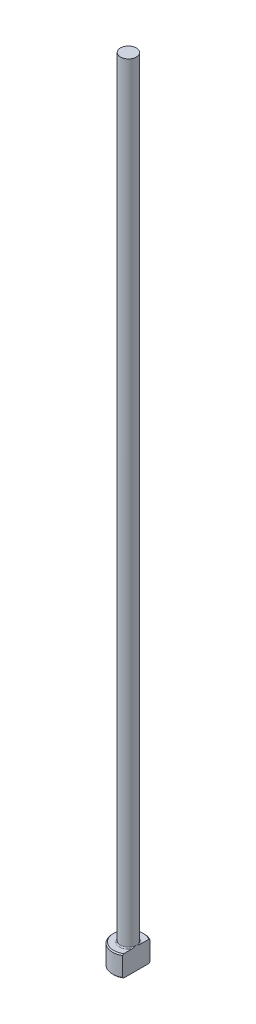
ISO-10303-21;
HEADER;
FILE_DESCRIPTION(('STEP AP214'),'2;1');
FILE_NAME('part.step','',(''),(''),'','','');
FILE_SCHEMA(('AUTOMOTIVE_DESIGN { 1 0 10303 214 1 1 1 1 }'));
ENDSEC;
DATA;
#1=APPLICATION_CONTEXT('core data for automotive mechanical design processes');
#2=APPLICATION_PROTOCOL_DEFINITION('international standard','automotive_design',2000,#1);
#3=PRODUCT_CONTEXT('',#1,'mechanical');
#4=PRODUCT('Part','Part','',(#3));
#5=PRODUCT_RELATED_PRODUCT_CATEGORY('part','',(#4));
#6=PRODUCT_DEFINITION_FORMATION('','',#4);
#7=PRODUCT_DEFINITION_CONTEXT('part definition',#1,'design');
#8=PRODUCT_DEFINITION('design','',#6,#7);
#9=PRODUCT_DEFINITION_SHAPE('','',#8);
#10=(LENGTH_UNIT() NAMED_UNIT(*) SI_UNIT(.MILLI.,.METRE.));
#11=(NAMED_UNIT(*) PLANE_ANGLE_UNIT() SI_UNIT($,.RADIAN.));
#12=(NAMED_UNIT(*) SI_UNIT($,.STERADIAN.) SOLID_ANGLE_UNIT());
#13=UNCERTAINTY_MEASURE_WITH_UNIT(LENGTH_MEASURE(1.E-05),#10,'distance_accuracy_value','');
#14=(GEOMETRIC_REPRESENTATION_CONTEXT(3) GLOBAL_UNCERTAINTY_ASSIGNED_CONTEXT((#13)) GLOBAL_UNIT_ASSIGNED_CONTEXT((#10,
#11,#12)) REPRESENTATION_CONTEXT('',''));
#15=CARTESIAN_POINT('',(0.,0.,0.));
#16=DIRECTION('',(0.,0.,1.));
#17=DIRECTION('',(1.,0.,0.));
#18=AXIS2_PLACEMENT_3D('',#15,#16,#17);
#19=CARTESIAN_POINT('',(0.,0.,0.));
#20=DIRECTION('',(0.,-1.,0.));
#21=DIRECTION('',(0.,0.,-1.));
#22=AXIS2_PLACEMENT_3D('',#19,#20,#21);
#23=PLANE('',#22);
#24=CARTESIAN_POINT('',(0.,0.,0.));
#25=DIRECTION('',(0.,-1.,0.));
#26=DIRECTION('',(0.,0.,-1.));
#27=AXIS2_PLACEMENT_3D('',#24,#25,#26);
#28=CIRCLE('',#27,2.8);
#29=CARTESIAN_POINT('',(1.49999999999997,0.,2.36431808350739));
#30=VERTEX_POINT('',#29);
#31=CARTESIAN_POINT('',(1.49999999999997,0.,-2.36431808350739));
#32=VERTEX_POINT('',#31);
#33=EDGE_CURVE('E98',#30,#32,#28,.T.);
#34=ORIENTED_EDGE('',*,*,#33,.T.);
#35=DIRECTION('',(0.,0.,1.));
#36=VECTOR('',#35,1.);
#37=CARTESIAN_POINT('',(1.49999999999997,0.,2.5980762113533));
#38=LINE('',#37,#36);
#39=EDGE_CURVE('E83',#32,#30,#38,.T.);
#40=ORIENTED_EDGE('',*,*,#39,.T.);
#41=EDGE_LOOP('',(#34,#40));
#42=FACE_BOUND('',#41,.T.);
#43=ADVANCED_FACE('F32',(#42),#23,.T.);
#44=CARTESIAN_POINT('',(0.,259.958771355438,0.));
#45=DIRECTION('',(0.,1.,0.));
#46=DIRECTION('',(0.,0.,1.));
#47=AXIS2_PLACEMENT_3D('',#44,#45,#46);
#48=CYLINDRICAL_SURFACE('',#47,2.99999999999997);
#49=CARTESIAN_POINT('',(0.,3.79999999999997,0.));
#50=DIRECTION('',(0.,1.,0.));
#51=DIRECTION('',(0.,0.,1.));
#52=AXIS2_PLACEMENT_3D('',#49,#50,#51);
#53=CIRCLE('',#52,2.99999999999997);
#54=CARTESIAN_POINT('',(1.49999999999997,3.79999999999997,2.5980762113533));
#55=VERTEX_POINT('',#54);
#56=CARTESIAN_POINT('',(1.49999999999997,3.79999999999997,-2.5980762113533));
#57=VERTEX_POINT('',#56);
#58=EDGE_CURVE('E104',#55,#57,#53,.F.);
#59=ORIENTED_EDGE('',*,*,#58,.T.);
#60=DIRECTION('',(0.,-1.,0.));
#61=VECTOR('',#60,1.);
#62=CARTESIAN_POINT('',(1.49999999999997,150.,-2.5980762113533));
#63=LINE('',#62,#61);
#64=CARTESIAN_POINT('',(1.49999999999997,0.199999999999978,-2.5980762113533));
#65=VERTEX_POINT('',#64);
#66=EDGE_CURVE('E183',#57,#65,#63,.T.);
#67=ORIENTED_EDGE('',*,*,#66,.T.);
#68=CARTESIAN_POINT('',(0.,0.199999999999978,0.));
#69=DIRECTION('',(0.,-1.,0.));
#70=DIRECTION('',(0.,0.,-1.));
#71=AXIS2_PLACEMENT_3D('',#68,#69,#70);
#72=CIRCLE('',#71,2.99999999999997);
#73=CARTESIAN_POINT('',(1.49999999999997,0.199999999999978,2.5980762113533));
#74=VERTEX_POINT('',#73);
#75=EDGE_CURVE('E100',#65,#74,#72,.F.);
#76=ORIENTED_EDGE('',*,*,#75,.T.);
#77=DIRECTION('',(0.,-1.,0.));
#78=VECTOR('',#77,1.);
#79=CARTESIAN_POINT('',(1.49999999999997,150.,2.5980762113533));
#80=LINE('',#79,#78);
#81=EDGE_CURVE('E93',#55,#74,#80,.T.);
#82=ORIENTED_EDGE('',*,*,#81,.F.);
#83=EDGE_LOOP('',(#59,#67,#76,#82));
#84=FACE_BOUND('',#83,.T.);
#85=ADVANCED_FACE('F158',(#84),#48,.T.);
#86=CARTESIAN_POINT('',(-2.99999999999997,4.,0.));
#87=DIRECTION('',(0.,1.,0.));
#88=DIRECTION('',(0.,0.,1.));
#89=AXIS2_PLACEMENT_3D('',#86,#87,#88);
#90=PLANE('',#89);
#91=CARTESIAN_POINT('',(0.,4.,0.));
#92=DIRECTION('',(0.,1.,0.));
#93=DIRECTION('',(0.,0.,1.));
#94=AXIS2_PLACEMENT_3D('',#91,#92,#93);
#95=CIRCLE('',#94,2.79999999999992);
#96=CARTESIAN_POINT('',(1.49999999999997,4.,-2.3643180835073));
#97=VERTEX_POINT('',#96);
#98=CARTESIAN_POINT('',(1.49999999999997,4.,2.3643180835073));
#99=VERTEX_POINT('',#98);
#100=EDGE_CURVE('E178',#97,#99,#95,.T.);
#101=ORIENTED_EDGE('',*,*,#100,.T.);
#102=DIRECTION('',(0.,0.,-1.));
#103=VECTOR('',#102,1.);
#104=CARTESIAN_POINT('',(1.49999999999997,4.,0.));
#105=LINE('',#104,#103);
#106=CARTESIAN_POINT('',(1.49999999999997,3.99999999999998,0.799999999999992));
#107=VERTEX_POINT('',#106);
#108=EDGE_CURVE('E57',#99,#107,#105,.T.);
#109=ORIENTED_EDGE('',*,*,#108,.T.);
#110=CARTESIAN_POINT('',(0.,4.,0.));
#111=DIRECTION('',(0.,1.,0.));
#112=DIRECTION('',(0.,0.,1.));
#113=AXIS2_PLACEMENT_3D('',#110,#111,#112);
#114=CIRCLE('',#113,1.69999999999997);
#115=CARTESIAN_POINT('',(1.49999999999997,3.99999999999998,-0.799999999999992));
#116=VERTEX_POINT('',#115);
#117=EDGE_CURVE('E107',#107,#116,#114,.F.);
#118=ORIENTED_EDGE('',*,*,#117,.T.);
#119=EDGE_CURVE('E136',#116,#97,#105,.T.);
#120=ORIENTED_EDGE('',*,*,#119,.T.);
#121=EDGE_LOOP('',(#101,#109,#118,#120));
#122=FACE_BOUND('',#121,.T.);
#123=ADVANCED_FACE('F147',(#122),#90,.T.);
#124=CARTESIAN_POINT('',(0.,4.,0.));
#125=DIRECTION('',(0.,-1.,0.));
#126=DIRECTION('',(0.,0.,-1.));
#127=AXIS2_PLACEMENT_3D('',#124,#125,#126);
#128=CONICAL_SURFACE('',#127,2.79999999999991,0.7853981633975);
#129=ORIENTED_EDGE('',*,*,#58,.F.);
#130=CARTESIAN_POINT('',(1.49999999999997,0.888258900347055,5.71827621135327));
#131=CARTESIAN_POINT('',(1.49999999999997,1.01361833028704,5.58866816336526));
#132=CARTESIAN_POINT('',(1.49999999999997,1.13884324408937,5.45892957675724));
#133=CARTESIAN_POINT('',(1.49999999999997,1.38894444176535,5.19911365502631));
#134=CARTESIAN_POINT('',(1.49999999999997,1.51382072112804,5.06903631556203));
#135=CARTESIAN_POINT('',(1.49999999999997,1.76320568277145,4.8084018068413));
#136=CARTESIAN_POINT('',(1.49999999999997,1.88771414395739,4.67784442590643));
#137=CARTESIAN_POINT('',(1.49999999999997,2.13618059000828,4.41620813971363));
#138=CARTESIAN_POINT('',(1.49999999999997,2.26013857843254,4.28512923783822));
#139=CARTESIAN_POINT('',(1.49999999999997,2.50488975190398,4.02490837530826));
#140=CARTESIAN_POINT('',(1.49999999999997,2.62569693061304,3.89577958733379));
#141=CARTESIAN_POINT('',(1.49999999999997,2.86640694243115,3.63668213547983));
#142=CARTESIAN_POINT('',(1.49999999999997,2.98630978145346,3.5067134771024));
#143=CARTESIAN_POINT('',(1.49999999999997,3.22486033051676,3.24567921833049));
#144=CARTESIAN_POINT('',(1.49999999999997,3.34350830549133,3.11461386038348));
#145=CARTESIAN_POINT('',(1.49999999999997,3.57907716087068,2.85094268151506));
#146=CARTESIAN_POINT('',(1.49999999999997,3.69599811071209,2.71833692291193));
#147=CARTESIAN_POINT('',(1.49999999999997,3.88262371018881,2.50255231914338));
#148=CARTESIAN_POINT('',(1.49999999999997,3.95312454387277,2.42006293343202));
#149=CARTESIAN_POINT('',(1.49999999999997,4.09287098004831,2.25401084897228));
#150=CARTESIAN_POINT('',(1.49999999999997,4.16211645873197,2.170448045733));
#151=CARTESIAN_POINT('',(1.49999999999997,4.29964684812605,2.00105967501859));
#152=CARTESIAN_POINT('',(1.49999999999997,4.36791386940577,1.91521952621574));
#153=CARTESIAN_POINT('',(1.49999999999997,4.50205840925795,1.74171392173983));
#154=CARTESIAN_POINT('',(1.49999999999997,4.56793649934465,1.65404891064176));
#155=CARTESIAN_POINT('',(1.49999999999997,4.69728151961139,1.47490236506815));
#156=CARTESIAN_POINT('',(1.49999999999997,4.76069661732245,1.38338308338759));
#157=CARTESIAN_POINT('',(1.49999999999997,4.88239539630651,1.1967566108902));
#158=CARTESIAN_POINT('',(1.49999999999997,4.9406720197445,1.10164473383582));
#159=CARTESIAN_POINT('',(1.49999999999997,5.04841325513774,0.908008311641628));
#160=CARTESIAN_POINT('',(1.49999999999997,5.09797809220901,0.809540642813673));
#161=CARTESIAN_POINT('',(1.49999999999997,5.18432188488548,0.607192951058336));
#162=CARTESIAN_POINT('',(1.49999999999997,5.22114374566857,0.503332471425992));
#163=CARTESIAN_POINT('',(1.49999999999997,5.26099935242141,0.347577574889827));
#164=CARTESIAN_POINT('',(1.49999999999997,5.27157029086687,0.297609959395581));
#165=CARTESIAN_POINT('',(1.49999999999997,5.28794860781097,0.196885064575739));
#166=CARTESIAN_POINT('',(1.49999999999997,5.29375640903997,0.146127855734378));
#167=CARTESIAN_POINT('',(1.49999999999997,5.3001970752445,0.0444388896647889));
#168=CARTESIAN_POINT('',(1.49999999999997,5.3008459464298,-0.00649183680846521));
#169=CARTESIAN_POINT('',(1.49999999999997,5.29696416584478,-0.108155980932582));
#170=CARTESIAN_POINT('',(1.49999999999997,5.29243308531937,-0.158889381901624));
#171=CARTESIAN_POINT('',(1.49999999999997,5.2785691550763,-0.259234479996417));
#172=CARTESIAN_POINT('',(1.49999999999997,5.2692782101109,-0.308852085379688));
#173=CARTESIAN_POINT('',(1.49999999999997,5.24647108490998,-0.40711049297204));
#174=CARTESIAN_POINT('',(1.49999999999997,5.23295324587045,-0.455750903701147));
#175=CARTESIAN_POINT('',(1.49999999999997,5.20226175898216,-0.552149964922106));
#176=CARTESIAN_POINT('',(1.49999999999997,5.18506801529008,-0.5999021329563));
#177=CARTESIAN_POINT('',(1.49999999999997,5.14771387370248,-0.694205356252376));
#178=CARTESIAN_POINT('',(1.49999999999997,5.12755408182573,-0.740756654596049));
#179=CARTESIAN_POINT('',(1.49999999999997,5.06327696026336,-0.879166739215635));
#180=CARTESIAN_POINT('',(1.49999999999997,5.01551721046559,-0.969329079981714));
#181=CARTESIAN_POINT('',(1.49999999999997,4.91367909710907,-1.1460431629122));
#182=CARTESIAN_POINT('',(1.49999999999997,4.85959300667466,-1.23259031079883));
#183=CARTESIAN_POINT('',(1.49999999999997,4.74697968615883,-1.40321348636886));
#184=CARTESIAN_POINT('',(1.49999999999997,4.68843573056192,-1.48727838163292));
#185=CARTESIAN_POINT('',(1.49999999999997,4.56843845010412,-1.6532218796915));
#186=CARTESIAN_POINT('',(1.49999999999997,4.50698656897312,-1.73510153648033));
#187=CARTESIAN_POINT('',(1.49999999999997,4.38115673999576,-1.89829823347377));
#188=CARTESIAN_POINT('',(1.49999999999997,4.31675092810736,-1.9795936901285));
#189=CARTESIAN_POINT('',(1.49999999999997,4.18634068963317,-2.14090082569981));
#190=CARTESIAN_POINT('',(1.49999999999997,4.12033609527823,-2.22091236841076));
#191=CARTESIAN_POINT('',(1.49999999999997,3.92086431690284,-2.4590650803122));
#192=CARTESIAN_POINT('',(1.49999999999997,3.78562663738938,-2.61572090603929));
#193=CARTESIAN_POINT('',(1.49999999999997,3.53554498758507,-2.90006295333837));
#194=CARTESIAN_POINT('',(1.49999999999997,3.42114543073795,-3.02814382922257));
#195=CARTESIAN_POINT('',(1.49999999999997,3.19093557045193,-3.28303767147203));
#196=CARTESIAN_POINT('',(1.49999999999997,3.07512522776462,-3.40985060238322));
#197=CARTESIAN_POINT('',(1.49999999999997,2.72597067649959,-3.78913849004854));
#198=CARTESIAN_POINT('',(1.49999999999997,2.49111760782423,-4.04022177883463));
#199=CARTESIAN_POINT('',(1.49999999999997,2.02882478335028,-4.52992803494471));
#200=CARTESIAN_POINT('',(1.49999999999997,1.80147747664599,-4.76863870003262));
#201=CARTESIAN_POINT('',(1.49999999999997,1.45954865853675,-5.12558036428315));
#202=CARTESIAN_POINT('',(1.49999999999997,1.34548484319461,-5.24430773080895));
#203=CARTESIAN_POINT('',(1.49999999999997,1.11707176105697,-5.48148573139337));
#204=CARTESIAN_POINT('',(1.49999999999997,1.00272249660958,-5.59993636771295));
#205=CARTESIAN_POINT('',(1.49999999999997,0.888258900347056,-5.71827621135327));
#206=B_SPLINE_CURVE_WITH_KNOTS('',3,(#130,#131,#132,#133,#134,#135,#136,#137,#138,#139,#140,
#141,#142,#143,#144,#145,#146,#147,#148,#149,#150,#151,#152,#153,#154,#155,#156,#157,#158,#159,
#160,#161,#162,#163,#164,#165,#166,#167,#168,#169,#170,#171,#172,#173,#174,#175,#176,#177,#178,
#179,#180,#181,#182,#183,#184,#185,#186,#187,#188,#189,#190,#191,#192,#193,#194,#195,#196,#197,
#198,#199,#200,#201,#202,#203,#204,#205),.UNSPECIFIED.,.F.,.F.,(4,2,2,2,2,2,2,2,2,2,2,2,2,2,2,2,
2,2,2,2,2,2,2,2,2,2,2,2,2,2,2,2,2,2,2,2,2,4),(0.,0.540943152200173,1.08189327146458,
1.62312052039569,2.16434426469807,2.69482920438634,3.22531067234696,3.75567781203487,
4.28602356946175,4.61155053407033,4.93710943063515,5.26610945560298,5.59503024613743,
5.92894782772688,6.26331713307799,6.59354403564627,6.92264800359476,7.07567478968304,
7.22868799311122,7.38122626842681,7.53377717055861,7.68500755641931,7.83629736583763,
7.98843643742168,8.14054446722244,8.4461879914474,8.75220879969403,9.05944044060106,
9.36652111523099,9.677642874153,9.98879742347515,10.6095925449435,11.1247803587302,
11.6399825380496,12.6713544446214,13.6603005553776,14.1542238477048,14.648143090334),.UNSPECIFIED.);
#207=EDGE_CURVE('E135',#55,#99,#206,.T.);
#208=ORIENTED_EDGE('',*,*,#207,.T.);
#209=ORIENTED_EDGE('',*,*,#100,.F.);
#210=EDGE_CURVE('E127',#97,#57,#206,.T.);
#211=ORIENTED_EDGE('',*,*,#210,.T.);
#212=EDGE_LOOP('',(#129,#208,#209,#211));
#213=FACE_BOUND('',#212,.T.);
#214=ADVANCED_FACE('F143',(#213),#128,.T.);
#215=CARTESIAN_POINT('',(0.,0.199999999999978,0.));
#216=DIRECTION('',(0.,1.,0.));
#217=DIRECTION('',(0.,0.,1.));
#218=AXIS2_PLACEMENT_3D('',#215,#216,#217);
#219=CONICAL_SURFACE('',#218,2.99999999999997,0.785398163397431);
#220=ORIENTED_EDGE('',*,*,#75,.F.);
#221=CARTESIAN_POINT('',(1.49999999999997,3.1117410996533,-5.71827621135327));
#222=CARTESIAN_POINT('',(1.49999999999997,2.98638166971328,-5.58866816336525));
#223=CARTESIAN_POINT('',(1.49999999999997,2.86115675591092,-5.45892957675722));
#224=CARTESIAN_POINT('',(1.49999999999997,2.61105555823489,-5.19911365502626));
#225=CARTESIAN_POINT('',(1.49999999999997,2.48617927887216,-5.06903631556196));
#226=CARTESIAN_POINT('',(1.49999999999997,2.23679431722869,-4.8084018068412));
#227=CARTESIAN_POINT('',(1.49999999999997,2.11228585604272,-4.67784442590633));
#228=CARTESIAN_POINT('',(1.49999999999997,1.86381940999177,-4.4162081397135));
#229=CARTESIAN_POINT('',(1.49999999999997,1.73986142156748,-4.28512923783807));
#230=CARTESIAN_POINT('',(1.49999999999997,1.49511024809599,-4.02490837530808));
#231=CARTESIAN_POINT('',(1.49999999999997,1.3743030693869,-3.8957795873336));
#232=CARTESIAN_POINT('',(1.49999999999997,1.13359305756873,-3.63668213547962));
#233=CARTESIAN_POINT('',(1.49999999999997,1.0136902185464,-3.50671347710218));
#234=CARTESIAN_POINT('',(1.49999999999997,0.775139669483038,-3.24567921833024));
#235=CARTESIAN_POINT('',(1.49999999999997,0.656491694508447,-3.11461386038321));
#236=CARTESIAN_POINT('',(1.49999999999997,0.420922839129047,-2.85094268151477));
#237=CARTESIAN_POINT('',(1.49999999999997,0.304001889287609,-2.71833692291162));
#238=CARTESIAN_POINT('',(1.49999999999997,0.117376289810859,-2.50255231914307));
#239=CARTESIAN_POINT('',(1.49999999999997,0.0468754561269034,-2.42006293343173));
#240=CARTESIAN_POINT('',(1.49999999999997,-0.0928709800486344,-2.254010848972));
#241=CARTESIAN_POINT('',(1.49999999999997,-0.162116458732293,-2.17044804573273));
#242=CARTESIAN_POINT('',(1.49999999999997,-0.299646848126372,-2.00105967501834));
#243=CARTESIAN_POINT('',(1.49999999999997,-0.367913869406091,-1.9152195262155));
#244=CARTESIAN_POINT('',(1.49999999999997,-0.502058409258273,-1.7417139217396));
#245=CARTESIAN_POINT('',(1.49999999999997,-0.567936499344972,-1.65404891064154));
#246=CARTESIAN_POINT('',(1.49999999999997,-0.697281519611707,-1.47490236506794));
#247=CARTESIAN_POINT('',(1.49999999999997,-0.76069661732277,-1.38338308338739));
#248=CARTESIAN_POINT('',(1.49999999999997,-0.882395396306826,-1.19675661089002));
#249=CARTESIAN_POINT('',(1.49999999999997,-0.940672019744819,-1.10164473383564));
#250=CARTESIAN_POINT('',(1.49999999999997,-1.04841325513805,-0.908008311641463));
#251=CARTESIAN_POINT('',(1.49999999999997,-1.09797809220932,-0.809540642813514));
#252=CARTESIAN_POINT('',(1.49999999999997,-1.18432188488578,-0.607192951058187));
#253=CARTESIAN_POINT('',(1.49999999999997,-1.22114374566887,-0.503332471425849));
#254=CARTESIAN_POINT('',(1.49999999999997,-1.26099935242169,-0.347577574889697));
#255=CARTESIAN_POINT('',(1.49999999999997,-1.27157029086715,-0.297609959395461));
#256=CARTESIAN_POINT('',(1.49999999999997,-1.28794860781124,-0.196885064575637));
#257=CARTESIAN_POINT('',(1.49999999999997,-1.29375640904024,-0.146127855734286));
#258=CARTESIAN_POINT('',(1.49999999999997,-1.30019707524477,-0.0444388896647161));
#259=CARTESIAN_POINT('',(1.49999999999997,-1.30084594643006,0.00649183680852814));
#260=CARTESIAN_POINT('',(1.49999999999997,-1.29696416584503,0.108155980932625));
#261=CARTESIAN_POINT('',(1.49999999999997,-1.29243308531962,0.158889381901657));
#262=CARTESIAN_POINT('',(1.49999999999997,-1.27856915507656,0.259234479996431));
#263=CARTESIAN_POINT('',(1.49999999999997,-1.26927821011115,0.308852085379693));
#264=CARTESIAN_POINT('',(1.49999999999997,-1.24647108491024,0.407110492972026));
#265=CARTESIAN_POINT('',(1.49999999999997,-1.2329532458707,0.455750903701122));
#266=CARTESIAN_POINT('',(1.49999999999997,-1.20226175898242,0.552149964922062));
#267=CARTESIAN_POINT('',(1.49999999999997,-1.18506801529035,0.599902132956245));
#268=CARTESIAN_POINT('',(1.49999999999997,-1.14771387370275,0.694205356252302));
#269=CARTESIAN_POINT('',(1.49999999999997,-1.12755408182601,0.740756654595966));
#270=CARTESIAN_POINT('',(1.49999999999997,-1.06327696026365,0.879166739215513));
#271=CARTESIAN_POINT('',(1.49999999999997,-1.0155172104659,0.969329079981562));
#272=CARTESIAN_POINT('',(1.49999999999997,-0.913679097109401,1.14604316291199));
#273=CARTESIAN_POINT('',(1.49999999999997,-0.859593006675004,1.2325903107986));
#274=CARTESIAN_POINT('',(1.49999999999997,-0.746979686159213,1.40321348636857));
#275=CARTESIAN_POINT('',(1.49999999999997,-0.688435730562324,1.4872783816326));
#276=CARTESIAN_POINT('',(1.49999999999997,-0.56843845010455,1.65322187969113));
#277=CARTESIAN_POINT('',(1.49999999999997,-0.506986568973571,1.73510153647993));
#278=CARTESIAN_POINT('',(1.49999999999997,-0.381156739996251,1.89829823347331));
#279=CARTESIAN_POINT('',(1.49999999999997,-0.316750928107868,1.97959369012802));
#280=CARTESIAN_POINT('',(1.49999999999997,-0.186340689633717,2.14090082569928));
#281=CARTESIAN_POINT('',(1.49999999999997,-0.120336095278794,2.2209123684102));
#282=CARTESIAN_POINT('',(1.49999999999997,0.0791356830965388,2.45906508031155));
#283=CARTESIAN_POINT('',(1.49999999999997,0.214373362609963,2.6157209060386));
#284=CARTESIAN_POINT('',(1.49999999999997,0.464455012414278,2.90006295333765));
#285=CARTESIAN_POINT('',(1.49999999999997,0.578854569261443,3.02814382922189));
#286=CARTESIAN_POINT('',(1.49999999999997,0.809064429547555,3.28303767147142));
#287=CARTESIAN_POINT('',(1.49999999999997,0.92487477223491,3.40985060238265));
#288=CARTESIAN_POINT('',(1.49999999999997,1.27402932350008,3.78913849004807));
#289=CARTESIAN_POINT('',(1.49999999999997,1.50888239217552,4.04022177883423));
#290=CARTESIAN_POINT('',(1.49999999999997,1.97117521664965,4.52992803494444));
#291=CARTESIAN_POINT('',(1.49999999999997,2.19852252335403,4.76863870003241));
#292=CARTESIAN_POINT('',(1.49999999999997,2.54045134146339,5.12558036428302));
#293=CARTESIAN_POINT('',(1.49999999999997,2.65451515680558,5.24430773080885));
#294=CARTESIAN_POINT('',(1.49999999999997,2.8829282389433,5.48148573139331));
#295=CARTESIAN_POINT('',(1.49999999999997,2.99727750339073,5.59993636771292));
#296=CARTESIAN_POINT('',(1.49999999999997,3.1117410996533,5.71827621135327));
#297=B_SPLINE_CURVE_WITH_KNOTS('',3,(#221,#222,#223,#224,#225,#226,#227,#228,#229,#230,#231,
#232,#233,#234,#235,#236,#237,#238,#239,#240,#241,#242,#243,#244,#245,#246,#247,#248,#249,#250,
#251,#252,#253,#254,#255,#256,#257,#258,#259,#260,#261,#262,#263,#264,#265,#266,#267,#268,#269,
#270,#271,#272,#273,#274,#275,#276,#277,#278,#279,#280,#281,#282,#283,#284,#285,#286,#287,#288,
#289,#290,#291,#292,#293,#294,#295,#296),.UNSPECIFIED.,.F.,.F.,(4,2,2,2,2,2,2,2,2,2,2,2,2,2,2,2,
2,2,2,2,2,2,2,2,2,2,2,2,2,2,2,2,2,2,2,2,2,4),(0.,0.540943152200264,1.08189327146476,
1.62312052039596,2.16434426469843,2.69482920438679,3.22531067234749,3.75567781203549,
4.28602356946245,4.611550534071,4.9371094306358,5.26610945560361,5.59503024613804,
5.92894782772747,6.26331713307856,6.59354403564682,6.92264800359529,7.07567478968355,
7.2286879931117,7.38122626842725,7.53377717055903,7.6850075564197,7.83629736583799,
7.98843643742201,8.14054446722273,8.44618799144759,8.75220879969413,9.05944044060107,
9.3665211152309,9.67764287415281,9.98879742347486,10.609592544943,11.1247803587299,
11.6399825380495,12.6713544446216,13.6603005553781,14.1542238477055,14.6481430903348),.UNSPECIFIED.);
#298=EDGE_CURVE('E86',#65,#32,#297,.T.);
#299=ORIENTED_EDGE('',*,*,#298,.T.);
#300=ORIENTED_EDGE('',*,*,#33,.F.);
#301=EDGE_CURVE('E89',#30,#74,#297,.T.);
#302=ORIENTED_EDGE('',*,*,#301,.T.);
#303=EDGE_LOOP('',(#220,#299,#300,#302));
#304=FACE_BOUND('',#303,.T.);
#305=ADVANCED_FACE('F97',(#304),#219,.T.);
#306=CARTESIAN_POINT('',(0.,4.19999999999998,0.));
#307=DIRECTION('',(0.,1.,0.));
#308=DIRECTION('',(0.,0.,1.));
#309=AXIS2_PLACEMENT_3D('',#306,#307,#308);
#310=TOROIDAL_SURFACE('',#309,1.69999999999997,0.2);
#311=CARTESIAN_POINT('',(1.49999999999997,4.19999999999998,0.));
#312=CARTESIAN_POINT('',(1.49999999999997,4.20000050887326,7.14686072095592E-11));
#313=CARTESIAN_POINT('',(1.49999999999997,4.20000101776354,-1.21663673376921E-07));
#314=CARTESIAN_POINT('',(1.49999999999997,4.20000199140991,-4.97616237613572E-07));
#315=CARTESIAN_POINT('',(1.49999999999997,4.20000245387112,-7.5651622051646E-07));
#316=CARTESIAN_POINT('',(1.49999999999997,4.20000338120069,-1.37642837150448E-06));
#317=CARTESIAN_POINT('',(1.49999999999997,4.20000384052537,-1.74563476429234E-06));
#318=CARTESIAN_POINT('',(1.49999999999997,4.20000469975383,-2.53565984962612E-06));
#319=CARTESIAN_POINT('',(1.49999999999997,4.20000510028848,-2.95582597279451E-06));
#320=CARTESIAN_POINT('',(1.49999999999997,4.20000646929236,-4.48430445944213E-06));
#321=CARTESIAN_POINT('',(1.49999999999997,4.20000736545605,-5.65861039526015E-06));
#322=CARTESIAN_POINT('',(1.49999999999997,4.20000893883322,-8.06479202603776E-06));
#323=CARTESIAN_POINT('',(1.49999999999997,4.20000962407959,-9.29170517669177E-06));
#324=CARTESIAN_POINT('',(1.49999999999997,4.20001225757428,-1.416232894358E-05));
#325=CARTESIAN_POINT('',(1.49999999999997,4.20001407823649,-1.78790031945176E-05));
#326=CARTESIAN_POINT('',(1.49999999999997,4.20001699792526,-2.51443066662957E-05));
#327=CARTESIAN_POINT('',(1.49999999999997,4.20001815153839,-2.86715394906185E-05));
#328=CARTESIAN_POINT('',(1.49999999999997,4.20002315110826,-4.39218128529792E-05));
#329=CARTESIAN_POINT('',(1.49999999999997,4.20002701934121,-5.56288390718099E-05));
#330=CARTESIAN_POINT('',(1.49999999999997,4.20003312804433,-7.7405829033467E-05));
#331=CARTESIAN_POINT('',(1.49999999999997,4.20003553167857,-8.7427841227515E-05));
#332=CARTESIAN_POINT('',(1.49999999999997,4.20005483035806,-0.000161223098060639));
#333=CARTESIAN_POINT('',(1.49999999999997,4.20007979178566,-0.000222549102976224));
#334=CARTESIAN_POINT('',(1.49999999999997,4.20017391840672,-0.000462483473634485));
#335=CARTESIAN_POINT('',(1.49999999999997,4.20023706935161,-0.000642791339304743));
#336=CARTESIAN_POINT('',(1.49999999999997,4.20048761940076,-0.00134785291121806));
#337=CARTESIAN_POINT('',(1.49999999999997,4.20068132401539,-0.00187087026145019));
#338=CARTESIAN_POINT('',(1.49999999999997,4.20147357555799,-0.00402004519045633));
#339=CARTESIAN_POINT('',(1.49999999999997,4.20206499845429,-0.00564811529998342));
#340=CARTESIAN_POINT('',(1.49999999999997,4.20892634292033,-0.0245232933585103));
#341=CARTESIAN_POINT('',(1.49999999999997,4.21523683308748,-0.0417598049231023));
#342=CARTESIAN_POINT('',(1.49999999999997,4.22755028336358,-0.0756091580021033));
#343=CARTESIAN_POINT('',(1.49999999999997,4.23355589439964,-0.0922211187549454));
#344=CARTESIAN_POINT('',(1.49999999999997,4.24620101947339,-0.12745424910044));
#345=CARTESIAN_POINT('',(1.49999999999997,4.25283080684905,-0.146078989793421));
#346=CARTESIAN_POINT('',(1.49999999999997,4.26599765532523,-0.183577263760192));
#347=CARTESIAN_POINT('',(1.49999999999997,4.27253305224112,-0.202451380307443));
#348=CARTESIAN_POINT('',(1.49999999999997,4.28834228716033,-0.248982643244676));
#349=CARTESIAN_POINT('',(1.49999999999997,4.2974915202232,-0.276682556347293));
#350=CARTESIAN_POINT('',(1.49999999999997,4.31490935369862,-0.331625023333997));
#351=CARTESIAN_POINT('',(1.49999999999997,4.32319386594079,-0.35886250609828));
#352=CARTESIAN_POINT('',(1.49999999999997,4.34051594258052,-0.419125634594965));
#353=CARTESIAN_POINT('',(1.49999999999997,4.34936607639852,-0.452206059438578));
#354=CARTESIAN_POINT('',(1.49999999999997,4.36549583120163,-0.519023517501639));
#355=CARTESIAN_POINT('',(1.49999999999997,4.37276283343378,-0.55276364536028));
#356=CARTESIAN_POINT('',(1.49999999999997,4.38554755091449,-0.623053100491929));
#357=CARTESIAN_POINT('',(1.49999999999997,4.39090573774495,-0.659632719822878));
#358=CARTESIAN_POINT('',(1.49999999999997,4.39825016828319,-0.733028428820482));
#359=CARTESIAN_POINT('',(1.49999999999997,4.40024734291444,-0.769843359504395));
#360=CARTESIAN_POINT('',(1.49999999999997,4.39970780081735,-0.842856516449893));
#361=CARTESIAN_POINT('',(1.49999999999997,4.39725347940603,-0.87905368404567));
#362=CARTESIAN_POINT('',(1.49999999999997,4.38900085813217,-0.932380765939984));
#363=CARTESIAN_POINT('',(1.49999999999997,4.38553049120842,-0.949868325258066));
#364=CARTESIAN_POINT('',(1.49999999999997,4.37678336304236,-0.984374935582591));
#365=CARTESIAN_POINT('',(1.49999999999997,4.37150943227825,-1.00139467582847));
#366=CARTESIAN_POINT('',(1.49999999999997,4.35869781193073,-1.03479423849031));
#367=CARTESIAN_POINT('',(1.49999999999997,4.3511359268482,-1.05116499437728));
#368=CARTESIAN_POINT('',(1.49999999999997,4.33325333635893,-1.08234828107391));
#369=CARTESIAN_POINT('',(1.49999999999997,4.32294266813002,-1.097166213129));
#370=CARTESIAN_POINT('',(1.49999999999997,4.30512758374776,-1.11714173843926));
#371=CARTESIAN_POINT('',(1.49999999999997,4.29884721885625,-1.1233906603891));
#372=CARTESIAN_POINT('',(1.49999999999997,4.28545950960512,-1.13494695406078));
#373=CARTESIAN_POINT('',(1.49999999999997,4.27835226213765,-1.14025443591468));
#374=CARTESIAN_POINT('',(1.49999999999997,4.26325970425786,-1.14967631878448));
#375=CARTESIAN_POINT('',(1.49999999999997,4.25526534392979,-1.1537764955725));
#376=CARTESIAN_POINT('',(1.49999999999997,4.23863207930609,-1.16034952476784));
#377=CARTESIAN_POINT('',(1.49999999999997,4.22999427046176,-1.16282507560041));
#378=CARTESIAN_POINT('',(1.49999999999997,4.21343922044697,-1.16570267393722));
#379=CARTESIAN_POINT('',(1.49999999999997,4.20555896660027,-1.16631687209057));
#380=CARTESIAN_POINT('',(1.49999999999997,4.18982775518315,-1.16602054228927));
#381=CARTESIAN_POINT('',(1.49999999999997,4.18197679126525,-1.16511036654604));
#382=CARTESIAN_POINT('',(1.49999999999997,4.16747846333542,-1.16204446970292));
#383=CARTESIAN_POINT('',(1.49999999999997,4.16079696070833,-1.16004509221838));
#384=CARTESIAN_POINT('',(1.49999999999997,4.14781700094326,-1.15505972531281));
#385=CARTESIAN_POINT('',(1.49999999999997,4.14151862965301,-1.1520735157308));
#386=CARTESIAN_POINT('',(1.49999999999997,4.12690214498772,-1.14387585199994));
#387=CARTESIAN_POINT('',(1.49999999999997,4.11881436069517,-1.13825400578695));
#388=CARTESIAN_POINT('',(1.49999999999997,4.10364440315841,-1.12578441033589));
#389=CARTESIAN_POINT('',(1.49999999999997,4.09656475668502,-1.11893367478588));
#390=CARTESIAN_POINT('',(1.49999999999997,4.08012297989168,-1.10074342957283));
#391=CARTESIAN_POINT('',(1.49999999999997,4.07136543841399,-1.08886044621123));
#392=CARTESIAN_POINT('',(1.49999999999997,4.05578194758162,-1.06392743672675));
#393=CARTESIAN_POINT('',(1.49999999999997,4.0489571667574,-1.05087671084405));
#394=CARTESIAN_POINT('',(1.49999999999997,4.03273856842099,-1.0147230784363));
#395=CARTESIAN_POINT('',(1.49999999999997,4.02486230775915,-0.990945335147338));
#396=CARTESIAN_POINT('',(1.49999999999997,4.01257693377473,-0.942321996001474));
#397=CARTESIAN_POINT('',(1.49999999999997,4.00820590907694,-0.917467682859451));
#398=CARTESIAN_POINT('',(1.49999999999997,4.00229956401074,-0.867912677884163));
#399=CARTESIAN_POINT('',(1.49999999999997,4.0007128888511,-0.843217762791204));
#400=CARTESIAN_POINT('',(1.49999999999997,3.9996723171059,-0.793746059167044));
#401=CARTESIAN_POINT('',(1.49999999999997,4.0002230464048,-0.768969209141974));
#402=CARTESIAN_POINT('',(1.49999999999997,4.00433101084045,-0.696994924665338));
#403=CARTESIAN_POINT('',(1.49999999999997,4.01016976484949,-0.649931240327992));
#404=CARTESIAN_POINT('',(1.49999999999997,4.02567776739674,-0.559166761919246));
#405=CARTESIAN_POINT('',(1.49999999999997,4.03511950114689,-0.515423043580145));
#406=CARTESIAN_POINT('',(1.49999999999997,4.05693059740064,-0.427590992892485));
#407=CARTESIAN_POINT('',(1.49999999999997,4.06936356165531,-0.383518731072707));
#408=CARTESIAN_POINT('',(1.49999999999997,4.09174953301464,-0.310161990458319));
#409=CARTESIAN_POINT('',(1.49999999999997,4.10119843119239,-0.280718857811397));
#410=CARTESIAN_POINT('',(1.49999999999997,4.12060442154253,-0.222340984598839));
#411=CARTESIAN_POINT('',(1.49999999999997,4.13055519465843,-0.193404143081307));
#412=CARTESIAN_POINT('',(1.49999999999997,4.14973721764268,-0.138756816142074));
#413=CARTESIAN_POINT('',(1.49999999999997,4.15893123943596,-0.113033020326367));
#414=CARTESIAN_POINT('',(1.49999999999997,4.1778803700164,-0.0606351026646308));
#415=CARTESIAN_POINT('',(1.49999999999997,4.18764328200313,-0.0339636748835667));
#416=CARTESIAN_POINT('',(1.49999999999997,4.19793548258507,-0.00564657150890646));
#417=CARTESIAN_POINT('',(1.49999999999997,4.19852751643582,-0.00401699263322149));
#418=CARTESIAN_POINT('',(1.49999999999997,4.19931992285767,-0.00186745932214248));
#419=CARTESIAN_POINT('',(1.49999999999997,4.1995131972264,-0.00134559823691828));
#420=CARTESIAN_POINT('',(1.49999999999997,4.19976322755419,-0.000641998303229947));
#421=CARTESIAN_POINT('',(1.49999999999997,4.19982627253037,-0.000461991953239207));
#422=CARTESIAN_POINT('',(1.49999999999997,4.19992025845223,-0.000222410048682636));
#423=CARTESIAN_POINT('',(1.49999999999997,4.19994519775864,-0.000161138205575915));
#424=CARTESIAN_POINT('',(1.49999999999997,4.19996448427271,-8.74039267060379E-05));
#425=CARTESIAN_POINT('',(1.49999999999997,4.19996688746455,-7.73857556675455E-05));
#426=CARTESIAN_POINT('',(1.49999999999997,4.19997299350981,-5.56173272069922E-05));
#427=CARTESIAN_POINT('',(1.49999999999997,4.19997685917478,-4.39149186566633E-05));
#428=CARTESIAN_POINT('',(1.49999999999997,4.19998185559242,-2.86698156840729E-05));
#429=CARTESIAN_POINT('',(1.49999999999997,4.19998300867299,-2.51431575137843E-05));
#430=CARTESIAN_POINT('',(1.49999999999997,4.19998592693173,-1.78789552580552E-05));
#431=CARTESIAN_POINT('',(1.49999999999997,4.19998774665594,-1.41627846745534E-05));
#432=CARTESIAN_POINT('',(1.49999999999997,4.19999037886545,-9.29264488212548E-06));
#433=CARTESIAN_POINT('',(1.49999999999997,4.19999106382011,-8.06577599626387E-06));
#434=CARTESIAN_POINT('',(1.49999999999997,4.19999263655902,-5.65962639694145E-06));
#435=CARTESIAN_POINT('',(1.49999999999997,4.19999353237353,-4.48530466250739E-06));
#436=CARTESIAN_POINT('',(1.49999999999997,4.19999490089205,-2.95673740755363E-06));
#437=CARTESIAN_POINT('',(1.49999999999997,4.1999953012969,-2.53653208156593E-06));
#438=CARTESIAN_POINT('',(1.49999999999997,4.19999616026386,-1.74640525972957E-06));
#439=CARTESIAN_POINT('',(1.49999999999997,4.19999661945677,-1.37713598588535E-06));
#440=CARTESIAN_POINT('',(1.49999999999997,4.19999754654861,-7.57072336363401E-07));
#441=CARTESIAN_POINT('',(1.49999999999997,4.19999800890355,-4.98087387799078E-07));
#442=CARTESIAN_POINT('',(1.49999999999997,4.19999898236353,-1.21927250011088E-07));
#443=CARTESIAN_POINT('',(1.49999999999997,4.19999949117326,-7.14620692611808E-11));
#444=CARTESIAN_POINT('',(1.49999999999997,4.19999999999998,0.));
#445=B_SPLINE_CURVE_WITH_KNOTS('',3,(#311,#312,#313,#314,#315,#316,#317,#318,#319,#320,#321,
#322,#323,#324,#325,#326,#327,#328,#329,#330,#331,#332,#333,#334,#335,#336,#337,#338,#339,#340,
#341,#342,#343,#344,#345,#346,#347,#348,#349,#350,#351,#352,#353,#354,#355,#356,#357,#358,#359,
#360,#361,#362,#363,#364,#365,#366,#367,#368,#369,#370,#371,#372,#373,#374,#375,#376,#377,#378,
#379,#380,#381,#382,#383,#384,#385,#386,#387,#388,#389,#390,#391,#392,#393,#394,#395,#396,#397,
#398,#399,#400,#401,#402,#403,#404,#405,#406,#407,#408,#409,#410,#411,#412,#413,#414,#415,#416,
#417,#418,#419,#420,#421,#422,#423,#424,#425,#426,#427,#428,#429,#430,#431,#432,#433,#434,#435,
#436,#437,#438,#439,#440,#441,#442,#443,#444),.UNSPECIFIED.,.T.,.F.,(4,2,2,2,2,2,2,2,2,2,2,2,2,
2,2,2,2,2,2,2,2,2,2,2,2,2,2,2,2,2,2,2,2,2,2,2,2,2,2,2,2,2,2,2,2,2,2,2,2,2,2,2,2,2,2,2,2,2,2,2,2,
2,2,2,2,2,4),(0.,1.5268750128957E-06,3.10959387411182E-06,4.86976756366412E-06,
6.60940084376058E-06,1.10202525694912E-05,1.5232779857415E-05,2.76140371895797E-05,
3.87351645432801E-05,7.5718833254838E-05,0.000106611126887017,0.000304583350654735,
0.000878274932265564,0.00255078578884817,0.00774802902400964,0.0628090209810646,
0.115802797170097,0.175110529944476,0.235030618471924,0.322539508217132,0.407938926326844,
0.510638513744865,0.614128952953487,0.724918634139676,0.835347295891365,0.943752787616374,
0.997165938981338,1.05049564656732,1.10441029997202,1.1581307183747,1.18463966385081,
1.21114550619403,1.23795217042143,1.26471419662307,1.28828324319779,1.31184684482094,
1.33268332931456,1.35352446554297,1.38290826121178,1.41236445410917,1.45639976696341,
1.5004616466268,1.5751878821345,1.65071550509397,1.72483484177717,1.79911468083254,
1.94105061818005,2.07520625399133,2.21251544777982,2.30527614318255,2.39707056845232,
2.47902409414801,2.56422207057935,2.56942417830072,2.5710929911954,2.57166572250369,
2.57186352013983,2.5718944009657,2.57193136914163,2.57194248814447,2.57195486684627,
2.57195907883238,2.57196348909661,2.57196522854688,2.57196698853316,2.57196857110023,
2.57197009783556),.UNSPECIFIED.);
#446=CARTESIAN_POINT('',(1.49999999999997,4.19999999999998,0.));
#447=VERTEX_POINT('',#446);
#448=EDGE_CURVE('E11',#116,#447,#445,.T.);
#449=ORIENTED_EDGE('',*,*,#448,.F.);
#450=ORIENTED_EDGE('',*,*,#117,.F.);
#451=CARTESIAN_POINT('',(1.49999999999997,4.19999999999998,0.));
#452=CARTESIAN_POINT('',(1.49999999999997,4.1999994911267,-7.14686002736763E-11));
#453=CARTESIAN_POINT('',(1.49999999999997,4.19999898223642,1.21663673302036E-07));
#454=CARTESIAN_POINT('',(1.49999999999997,4.19999800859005,4.97616237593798E-07));
#455=CARTESIAN_POINT('',(1.49999999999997,4.19999754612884,7.56516220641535E-07));
#456=CARTESIAN_POINT('',(1.49999999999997,4.19999661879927,1.37642837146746E-06));
#457=CARTESIAN_POINT('',(1.49999999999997,4.1999961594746,1.74563476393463E-06));
#458=CARTESIAN_POINT('',(1.49999999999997,4.19999530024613,2.5356598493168E-06));
#459=CARTESIAN_POINT('',(1.49999999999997,4.19999489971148,2.95582597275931E-06));
#460=CARTESIAN_POINT('',(1.49999999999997,4.1999935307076,4.48430446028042E-06));
#461=CARTESIAN_POINT('',(1.49999999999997,4.19999263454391,5.65861039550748E-06));
#462=CARTESIAN_POINT('',(1.49999999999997,4.19999106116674,8.06479202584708E-06));
#463=CARTESIAN_POINT('',(1.49999999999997,4.19999037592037,9.29170517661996E-06));
#464=CARTESIAN_POINT('',(1.49999999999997,4.19998774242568,1.41623289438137E-05));
#465=CARTESIAN_POINT('',(1.49999999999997,4.19998592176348,1.78790031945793E-05));
#466=CARTESIAN_POINT('',(1.49999999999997,4.1999830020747,2.51443066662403E-05));
#467=CARTESIAN_POINT('',(1.49999999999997,4.19998184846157,2.86715394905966E-05));
#468=CARTESIAN_POINT('',(1.49999999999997,4.1999768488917,4.39218128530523E-05));
#469=CARTESIAN_POINT('',(1.49999999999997,4.19997298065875,5.56288390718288E-05));
#470=CARTESIAN_POINT('',(1.49999999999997,4.19996687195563,7.74058290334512E-05));
#471=CARTESIAN_POINT('',(1.49999999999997,4.1999644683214,8.7427841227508E-05));
#472=CARTESIAN_POINT('',(1.49999999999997,4.1999451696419,0.000161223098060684));
#473=CARTESIAN_POINT('',(1.49999999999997,4.1999202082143,0.000222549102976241));
#474=CARTESIAN_POINT('',(1.49999999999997,4.19982608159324,0.000462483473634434));
#475=CARTESIAN_POINT('',(1.49999999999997,4.19976293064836,0.000642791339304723));
#476=CARTESIAN_POINT('',(1.49999999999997,4.1995123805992,0.00134785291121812));
#477=CARTESIAN_POINT('',(1.49999999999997,4.19931867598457,0.00187087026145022));
#478=CARTESIAN_POINT('',(1.49999999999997,4.19852642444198,0.00402004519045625));
#479=CARTESIAN_POINT('',(1.49999999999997,4.19793500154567,0.00564811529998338));
#480=CARTESIAN_POINT('',(1.49999999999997,4.19107365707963,0.0245232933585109));
#481=CARTESIAN_POINT('',(1.49999999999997,4.18476316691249,0.0417598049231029));
#482=CARTESIAN_POINT('',(1.49999999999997,4.17244971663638,0.0756091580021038));
#483=CARTESIAN_POINT('',(1.49999999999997,4.16644410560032,0.0922211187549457));
#484=CARTESIAN_POINT('',(1.49999999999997,4.15379898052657,0.12745424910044));
#485=CARTESIAN_POINT('',(1.49999999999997,4.14716919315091,0.146078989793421));
#486=CARTESIAN_POINT('',(1.49999999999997,4.13400234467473,0.183577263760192));
#487=CARTESIAN_POINT('',(1.49999999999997,4.12746694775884,0.202451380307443));
#488=CARTESIAN_POINT('',(1.49999999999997,4.11165771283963,0.248982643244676));
#489=CARTESIAN_POINT('',(1.49999999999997,4.10250847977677,0.276682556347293));
#490=CARTESIAN_POINT('',(1.49999999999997,4.08509064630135,0.331625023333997));
#491=CARTESIAN_POINT('',(1.49999999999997,4.07680613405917,0.35886250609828));
#492=CARTESIAN_POINT('',(1.49999999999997,4.05948405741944,0.419125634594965));
#493=CARTESIAN_POINT('',(1.49999999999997,4.05063392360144,0.452206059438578));
#494=CARTESIAN_POINT('',(1.49999999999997,4.03450416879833,0.51902351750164));
#495=CARTESIAN_POINT('',(1.49999999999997,4.02723716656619,0.55276364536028));
#496=CARTESIAN_POINT('',(1.49999999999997,4.01445244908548,0.623053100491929));
#497=CARTESIAN_POINT('',(1.49999999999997,4.00909426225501,0.659632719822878));
#498=CARTESIAN_POINT('',(1.49999999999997,4.00174983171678,0.733028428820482));
#499=CARTESIAN_POINT('',(1.49999999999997,3.99975265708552,0.769843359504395));
#500=CARTESIAN_POINT('',(1.49999999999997,4.00029219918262,0.842856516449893));
#501=CARTESIAN_POINT('',(1.49999999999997,4.00274652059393,0.87905368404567));
#502=CARTESIAN_POINT('',(1.49999999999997,4.0109991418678,0.932380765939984));
#503=CARTESIAN_POINT('',(1.49999999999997,4.01446950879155,0.949868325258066));
#504=CARTESIAN_POINT('',(1.49999999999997,4.02321663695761,0.984374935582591));
#505=CARTESIAN_POINT('',(1.49999999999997,4.02849056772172,1.00139467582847));
#506=CARTESIAN_POINT('',(1.49999999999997,4.04130218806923,1.03479423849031));
#507=CARTESIAN_POINT('',(1.49999999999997,4.04886407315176,1.05116499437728));
#508=CARTESIAN_POINT('',(1.49999999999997,4.06674666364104,1.08234828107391));
#509=CARTESIAN_POINT('',(1.49999999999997,4.07705733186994,1.097166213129));
#510=CARTESIAN_POINT('',(1.49999999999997,4.09487241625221,1.11714173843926));
#511=CARTESIAN_POINT('',(1.49999999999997,4.10115278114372,1.1233906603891));
#512=CARTESIAN_POINT('',(1.49999999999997,4.11454049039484,1.13494695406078));
#513=CARTESIAN_POINT('',(1.49999999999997,4.12164773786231,1.14025443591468));
#514=CARTESIAN_POINT('',(1.49999999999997,4.13674029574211,1.14967631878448));
#515=CARTESIAN_POINT('',(1.49999999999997,4.14473465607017,1.1537764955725));
#516=CARTESIAN_POINT('',(1.49999999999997,4.16136792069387,1.16034952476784));
#517=CARTESIAN_POINT('',(1.49999999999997,4.1700057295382,1.16282507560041));
#518=CARTESIAN_POINT('',(1.49999999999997,4.18656077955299,1.16570267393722));
#519=CARTESIAN_POINT('',(1.49999999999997,4.19444103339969,1.16631687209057));
#520=CARTESIAN_POINT('',(1.49999999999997,4.21017224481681,1.16602054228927));
#521=CARTESIAN_POINT('',(1.49999999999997,4.21802320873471,1.16511036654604));
#522=CARTESIAN_POINT('',(1.49999999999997,4.23252153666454,1.16204446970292));
#523=CARTESIAN_POINT('',(1.49999999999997,4.23920303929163,1.16004509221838));
#524=CARTESIAN_POINT('',(1.49999999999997,4.2521829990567,1.15505972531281));
#525=CARTESIAN_POINT('',(1.49999999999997,4.25848137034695,1.1520735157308));
#526=CARTESIAN_POINT('',(1.49999999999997,4.27309785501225,1.14387585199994));
#527=CARTESIAN_POINT('',(1.49999999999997,4.28118563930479,1.13825400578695));
#528=CARTESIAN_POINT('',(1.49999999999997,4.29635559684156,1.12578441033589));
#529=CARTESIAN_POINT('',(1.49999999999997,4.30343524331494,1.11893367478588));
#530=CARTESIAN_POINT('',(1.49999999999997,4.31987702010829,1.10074342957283));
#531=CARTESIAN_POINT('',(1.49999999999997,4.32863456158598,1.08886044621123));
#532=CARTESIAN_POINT('',(1.49999999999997,4.34421805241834,1.06392743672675));
#533=CARTESIAN_POINT('',(1.49999999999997,4.35104283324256,1.05087671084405));
#534=CARTESIAN_POINT('',(1.49999999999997,4.36726143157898,1.0147230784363));
#535=CARTESIAN_POINT('',(1.49999999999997,4.37513769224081,0.990945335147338));
#536=CARTESIAN_POINT('',(1.49999999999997,4.38742306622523,0.942321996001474));
#537=CARTESIAN_POINT('',(1.49999999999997,4.39179409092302,0.917467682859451));
#538=CARTESIAN_POINT('',(1.49999999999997,4.39770043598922,0.867912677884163));
#539=CARTESIAN_POINT('',(1.49999999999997,4.39928711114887,0.843217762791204));
#540=CARTESIAN_POINT('',(1.49999999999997,4.40032768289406,0.793746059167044));
#541=CARTESIAN_POINT('',(1.49999999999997,4.39977695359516,0.768969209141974));
#542=CARTESIAN_POINT('',(1.49999999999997,4.39566898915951,0.696994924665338));
#543=CARTESIAN_POINT('',(1.49999999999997,4.38983023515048,0.649931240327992));
#544=CARTESIAN_POINT('',(1.49999999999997,4.37432223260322,0.559166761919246));
#545=CARTESIAN_POINT('',(1.49999999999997,4.36488049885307,0.515423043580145));
#546=CARTESIAN_POINT('',(1.49999999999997,4.34306940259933,0.427590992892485));
#547=CARTESIAN_POINT('',(1.49999999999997,4.33063643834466,0.383518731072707));
#548=CARTESIAN_POINT('',(1.49999999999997,4.30825046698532,0.310161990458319));
#549=CARTESIAN_POINT('',(1.49999999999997,4.29880156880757,0.280718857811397));
#550=CARTESIAN_POINT('',(1.49999999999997,4.27939557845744,0.222340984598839));
#551=CARTESIAN_POINT('',(1.49999999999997,4.26944480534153,0.193404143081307));
#552=CARTESIAN_POINT('',(1.49999999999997,4.25026278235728,0.138756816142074));
#553=CARTESIAN_POINT('',(1.49999999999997,4.241068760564,0.113033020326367));
#554=CARTESIAN_POINT('',(1.49999999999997,4.22211962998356,0.0606351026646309));
#555=CARTESIAN_POINT('',(1.49999999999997,4.21235671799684,0.0339636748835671));
#556=CARTESIAN_POINT('',(1.49999999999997,4.20206451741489,0.00564657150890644));
#557=CARTESIAN_POINT('',(1.49999999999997,4.20147248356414,0.00401699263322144));
#558=CARTESIAN_POINT('',(1.49999999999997,4.20068007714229,0.00186745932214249));
#559=CARTESIAN_POINT('',(1.49999999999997,4.20048680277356,0.00134559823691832));
#560=CARTESIAN_POINT('',(1.49999999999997,4.20023677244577,0.000641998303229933));
#561=CARTESIAN_POINT('',(1.49999999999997,4.2001737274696,0.000461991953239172));
#562=CARTESIAN_POINT('',(1.49999999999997,4.20007974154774,0.000222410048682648));
#563=CARTESIAN_POINT('',(1.49999999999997,4.20005480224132,0.000161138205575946));
#564=CARTESIAN_POINT('',(1.49999999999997,4.20003551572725,8.7403926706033E-05));
#565=CARTESIAN_POINT('',(1.49999999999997,4.20003311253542,7.73857556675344E-05));
#566=CARTESIAN_POINT('',(1.49999999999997,4.20002700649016,5.56173272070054E-05));
#567=CARTESIAN_POINT('',(1.49999999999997,4.20002314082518,4.39149186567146E-05));
#568=CARTESIAN_POINT('',(1.49999999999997,4.20001814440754,2.86698156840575E-05));
#569=CARTESIAN_POINT('',(1.49999999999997,4.20001699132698,2.51431575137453E-05));
#570=CARTESIAN_POINT('',(1.49999999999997,4.20001407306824,1.78789552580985E-05));
#571=CARTESIAN_POINT('',(1.49999999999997,4.20001225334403,1.41627846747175E-05));
#572=CARTESIAN_POINT('',(1.49999999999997,4.20000962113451,9.29264488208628E-06));
#573=CARTESIAN_POINT('',(1.49999999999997,4.20000893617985,8.06577599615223E-06));
#574=CARTESIAN_POINT('',(1.49999999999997,4.20000736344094,5.65962639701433E-06));
#575=CARTESIAN_POINT('',(1.49999999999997,4.20000646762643,4.48530466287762E-06));
#576=CARTESIAN_POINT('',(1.49999999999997,4.20000509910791,2.95673740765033E-06));
#577=CARTESIAN_POINT('',(1.49999999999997,4.20000469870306,2.53653208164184E-06));
#578=CARTESIAN_POINT('',(1.49999999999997,4.2000038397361,1.7464052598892E-06));
#579=CARTESIAN_POINT('',(1.49999999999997,4.20000338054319,1.37713598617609E-06));
#580=CARTESIAN_POINT('',(1.49999999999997,4.20000245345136,7.57072336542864E-07));
#581=CARTESIAN_POINT('',(1.49999999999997,4.20000199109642,4.98087387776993E-07));
#582=CARTESIAN_POINT('',(1.49999999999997,4.20000101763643,1.2192724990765E-07));
#583=CARTESIAN_POINT('',(1.49999999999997,4.20000050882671,7.14620623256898E-11));
#584=CARTESIAN_POINT('',(1.49999999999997,4.19999999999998,0.));
#585=B_SPLINE_CURVE_WITH_KNOTS('',3,(#451,#452,#453,#454,#455,#456,#457,#458,#459,#460,#461,
#462,#463,#464,#465,#466,#467,#468,#469,#470,#471,#472,#473,#474,#475,#476,#477,#478,#479,#480,
#481,#482,#483,#484,#485,#486,#487,#488,#489,#490,#491,#492,#493,#494,#495,#496,#497,#498,#499,
#500,#501,#502,#503,#504,#505,#506,#507,#508,#509,#510,#511,#512,#513,#514,#515,#516,#517,#518,
#519,#520,#521,#522,#523,#524,#525,#526,#527,#528,#529,#530,#531,#532,#533,#534,#535,#536,#537,
#538,#539,#540,#541,#542,#543,#544,#545,#546,#547,#548,#549,#550,#551,#552,#553,#554,#555,#556,
#557,#558,#559,#560,#561,#562,#563,#564,#565,#566,#567,#568,#569,#570,#571,#572,#573,#574,#575,
#576,#577,#578,#579,#580,#581,#582,#583,#584),.UNSPECIFIED.,.T.,.F.,(4,2,2,2,2,2,2,2,2,2,2,2,2,
2,2,2,2,2,2,2,2,2,2,2,2,2,2,2,2,2,2,2,2,2,2,2,2,2,2,2,2,2,2,2,2,2,2,2,2,2,2,2,2,2,2,2,2,2,2,2,2,
2,2,2,2,2,4),(0.,1.52687501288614E-06,3.10959387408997E-06,4.86976756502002E-06,
6.60940084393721E-06,1.10202525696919E-05,1.52327798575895E-05,2.76140371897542E-05,
3.87351645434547E-05,7.57188332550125E-05,0.000106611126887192,0.000304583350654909,
0.000878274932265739,0.00255078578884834,0.00774802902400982,0.0628090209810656,
0.115802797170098,0.175110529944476,0.235030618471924,0.322539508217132,0.407938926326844,
0.510638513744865,0.614128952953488,0.724918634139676,0.835347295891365,0.943752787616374,
0.997165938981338,1.05049564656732,1.10441029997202,1.1581307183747,1.18463966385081,
1.21114550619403,1.23795217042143,1.26471419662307,1.28828324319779,1.31184684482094,
1.33268332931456,1.35352446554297,1.38290826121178,1.41236445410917,1.45639976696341,
1.5004616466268,1.5751878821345,1.65071550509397,1.72483484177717,1.79911468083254,
1.94105061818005,2.07520625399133,2.21251544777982,2.30527614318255,2.39707056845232,
2.47902409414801,2.56422207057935,2.56942417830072,2.5710929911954,2.57166572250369,
2.57186352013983,2.5718944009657,2.57193136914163,2.57194248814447,2.57195486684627,
2.57195907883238,2.57196348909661,2.57196522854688,2.57196698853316,2.57196857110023,
2.57197009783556),.UNSPECIFIED.);
#586=EDGE_CURVE('E46',#447,#107,#585,.T.);
#587=ORIENTED_EDGE('',*,*,#586,.F.);
#588=CARTESIAN_POINT('',(0.,4.19999999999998,0.));
#589=DIRECTION('',(0.,1.,0.));
#590=DIRECTION('',(0.,0.,1.));
#591=AXIS2_PLACEMENT_3D('',#588,#589,#590);
#592=CIRCLE('',#591,1.49999999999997);
#593=EDGE_CURVE('E103',#447,#447,#592,.T.);
#594=ORIENTED_EDGE('',*,*,#593,.F.);
#595=EDGE_LOOP('',(#449,#450,#587,#594));
#596=FACE_BOUND('',#595,.T.);
#597=ADVANCED_FACE('F34',(#596),#310,.F.);
#598=CARTESIAN_POINT('',(0.,259.958771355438,0.));
#599=DIRECTION('',(0.,1.,0.));
#600=DIRECTION('',(0.,0.,1.));
#601=AXIS2_PLACEMENT_3D('',#598,#599,#600);
#602=CYLINDRICAL_SURFACE('',#601,1.49999999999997);
#603=ORIENTED_EDGE('',*,*,#593,.T.);
#604=EDGE_LOOP('',(#603));
#605=FACE_BOUND('',#604,.T.);
#606=CARTESIAN_POINT('',(0.,150.,0.));
#607=DIRECTION('',(0.,1.,0.));
#608=DIRECTION('',(0.,0.,1.));
#609=AXIS2_PLACEMENT_3D('',#606,#607,#608);
#610=CIRCLE('',#609,1.49999999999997);
#611=CARTESIAN_POINT('',(0.,150.,1.49999999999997));
#612=VERTEX_POINT('',#611);
#613=EDGE_CURVE('E101',#612,#612,#610,.T.);
#614=ORIENTED_EDGE('',*,*,#613,.F.);
#615=EDGE_LOOP('',(#614));
#616=FACE_BOUND('',#615,.T.);
#617=ADVANCED_FACE('F155',(#605,#616),#602,.T.);
#618=CARTESIAN_POINT('',(-1.49999999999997,150.,0.));
#619=DIRECTION('',(0.,1.,0.));
#620=DIRECTION('',(0.,0.,1.));
#621=AXIS2_PLACEMENT_3D('',#618,#619,#620);
#622=PLANE('',#621);
#623=ORIENTED_EDGE('',*,*,#613,.T.);
#624=EDGE_LOOP('',(#623));
#625=FACE_BOUND('',#624,.T.);
#626=ADVANCED_FACE('F121',(#625),#622,.T.);
#627=CARTESIAN_POINT('',(1.49999999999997,150.,2.5980762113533));
#628=DIRECTION('',(1.,0.,0.));
#629=DIRECTION('',(0.,0.,-1.));
#630=AXIS2_PLACEMENT_3D('',#627,#628,#629);
#631=PLANE('',#630);
#632=ORIENTED_EDGE('',*,*,#66,.F.);
#633=ORIENTED_EDGE('',*,*,#210,.F.);
#634=ORIENTED_EDGE('',*,*,#119,.F.);
#635=ORIENTED_EDGE('',*,*,#448,.T.);
#636=ORIENTED_EDGE('',*,*,#586,.T.);
#637=ORIENTED_EDGE('',*,*,#108,.F.);
#638=ORIENTED_EDGE('',*,*,#207,.F.);
#639=ORIENTED_EDGE('',*,*,#81,.T.);
#640=ORIENTED_EDGE('',*,*,#301,.F.);
#641=ORIENTED_EDGE('',*,*,#39,.F.);
#642=ORIENTED_EDGE('',*,*,#298,.F.);
#643=EDGE_LOOP('',(#632,#633,#634,#635,#636,#637,#638,#639,#640,#641,#642));
#644=FACE_BOUND('',#643,.T.);
#645=ADVANCED_FACE('F85',(#644),#631,.T.);
#646=CLOSED_SHELL('',(#43,#85,#123,#214,#305,#597,#617,#626,#645));
#647=MANIFOLD_SOLID_BREP('B2',#646);
#648=ADVANCED_BREP_SHAPE_REPRESENTATION('',(#18,#647),#14);
#649=SHAPE_DEFINITION_REPRESENTATION(#9,#648);
ENDSEC;
END-ISO-10303-21;
